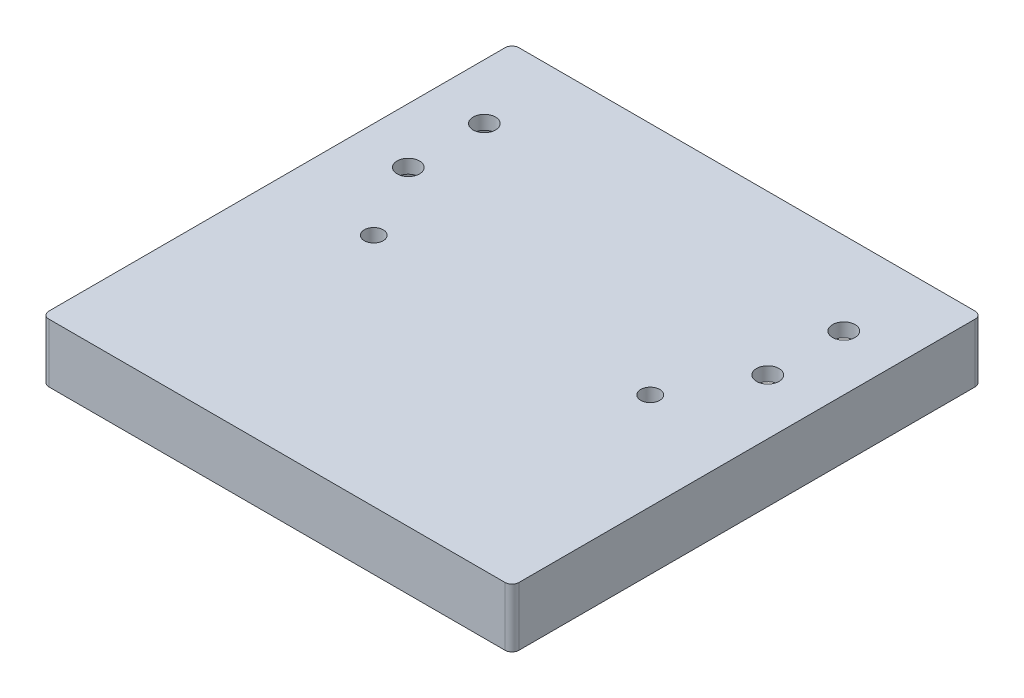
from build123d import *

# Parameters (mm, degrees)
SKETCH1_R                   = 3.25
SKETCH1_R_2                 = 2.75
BOSS_EXTRUDE2_DEPTH         = 17
SKETCH2_W                   = 128
SKETCH2_H                   = 128
CUT_EXTRUDE1_DEPTH          = 13
SKETCH3_R                   = 5
BOSS_EXTRUDE5_DEPTH         = 13
M5_TAPPED_HOLE2_D           = 4.2
M5_TAPPED_HOLE2_DEPTH       = 12
M5_TAPPED_HOLE2_CSINK_D     = 5.05
M5_TAPPED_HOLE2_CSINK_ANGLE = 90
M5_TAPPED_HOLE2_TIP         = 1.2618073


with BuildPart() as part:
    # Sketch1 → Boss-Extrude2 (new body)
    with BuildSketch(Plane(origin=(0, 0, 0), x_dir=(1, 0, 0), z_dir=(0, 1, 0))):
        with BuildLine():
            Line((-115.483389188, 45.425714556), (16.516610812, 45.425714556))
            ThreePointArc((16.516610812, 45.425714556), (17.930824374, 44.839928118), (18.516610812, 43.425714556))
            Line((18.516610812, 43.425714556), (18.516610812, -88.574285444))
            ThreePointArc((18.516610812, -88.574285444), (17.930824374, -89.988499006), (16.516610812, -90.574285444))
            Line((16.516610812, -90.574285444), (-115.483389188, -90.574285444))
            ThreePointArc((-115.483389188, -90.574285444), (-116.89760275, -89.988499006), (-117.483389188, -88.574285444))
            Line((-117.483389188, -88.574285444), (-117.483389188, 43.425714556))
            ThreePointArc((-117.483389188, 43.425714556), (-116.89760275, 44.839928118), (-115.483389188, 45.425714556))
        make_face()
        with Locations(Location((-101.483389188, 21.425714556, 0), (0, 0, 270))):
            Circle(SKETCH1_R, mode=Mode.SUBTRACT)
        with Locations(Location((-101.483389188, -0.574285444, 0), (0, 0, 270))):
            Circle(SKETCH1_R, mode=Mode.SUBTRACT)
        with Locations(Location((2.516610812, 21.425714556, 0), (0, 0, 270))):
            Circle(SKETCH1_R, mode=Mode.SUBTRACT)
        with Locations(Location((2.516610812, -0.574285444, 0), (0, 0, 270))):
            Circle(SKETCH1_R, mode=Mode.SUBTRACT)
        with Locations(Location((-89.483389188, -22.574285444, 0), (0, 0, 270))):
            Circle(SKETCH1_R_2, mode=Mode.SUBTRACT)
        with Locations(Location((-9.483389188, -22.574285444, 0), (0, 0, 270))):
            Circle(SKETCH1_R_2, mode=Mode.SUBTRACT)
    extrude(amount=BOSS_EXTRUDE2_DEPTH)

    # Sketch2 → Cut-Extrude1 (cut)
    with BuildSketch(Plane.XZ):
        with Locations((-49.483389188, 22.574285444)):
            Rectangle(SKETCH2_W, SKETCH2_H)
    extrude(amount=-CUT_EXTRUDE1_DEPTH, mode=Mode.SUBTRACT)

    # Sketch3 → Boss-Extrude5 (add)
    with BuildSketch(Plane.XZ.offset(-13)):
        with Locations(Location((-49.483389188, 22.574285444, 0), (0, 0, 90))):
            Circle(SKETCH3_R)
    extrude(amount=BOSS_EXTRUDE5_DEPTH)

    # M5 Tapped Hole2
    with Locations(Plane(origin=(0, 0, 0), x_dir=(-1, 0, 0), z_dir=(0, -1, 0))):
        with Locations((49.483389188, -22.668142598)):
            CounterSinkHole(M5_TAPPED_HOLE2_D / 2, M5_TAPPED_HOLE2_CSINK_D / 2, depth=M5_TAPPED_HOLE2_DEPTH, counter_sink_angle=M5_TAPPED_HOLE2_CSINK_ANGLE)
            with Locations((0, 0, -(M5_TAPPED_HOLE2_DEPTH + M5_TAPPED_HOLE2_TIP / 2))):  # 118° drill point
                Cone(0, M5_TAPPED_HOLE2_D / 2, M5_TAPPED_HOLE2_TIP, mode=Mode.SUBTRACT)


solid = part.part
